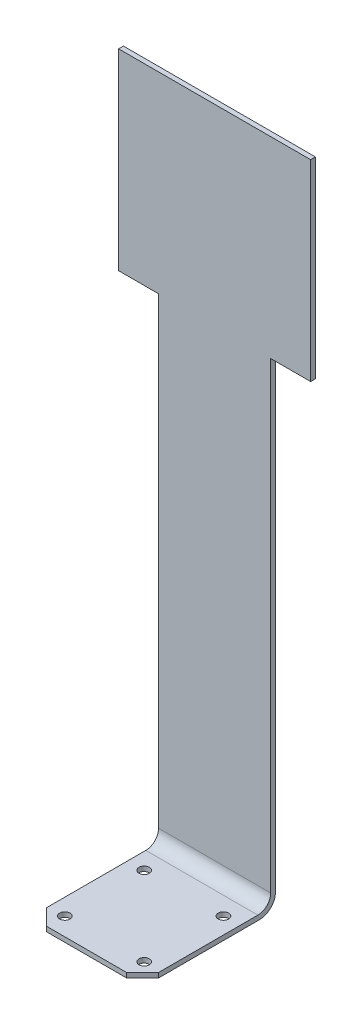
ISO-10303-21;
HEADER;
FILE_DESCRIPTION(('STEP AP214'),'2;1');
FILE_NAME('part.step','',(''),(''),'','','');
FILE_SCHEMA(('AUTOMOTIVE_DESIGN { 1 0 10303 214 1 1 1 1 }'));
ENDSEC;
DATA;
#1=APPLICATION_CONTEXT('core data for automotive mechanical design processes');
#2=APPLICATION_PROTOCOL_DEFINITION('international standard','automotive_design',2000,#1);
#3=PRODUCT_CONTEXT('',#1,'mechanical');
#4=PRODUCT('Part','Part','',(#3));
#5=PRODUCT_RELATED_PRODUCT_CATEGORY('part','',(#4));
#6=PRODUCT_DEFINITION_FORMATION('','',#4);
#7=PRODUCT_DEFINITION_CONTEXT('part definition',#1,'design');
#8=PRODUCT_DEFINITION('design','',#6,#7);
#9=PRODUCT_DEFINITION_SHAPE('','',#8);
#10=(LENGTH_UNIT() NAMED_UNIT(*) SI_UNIT(.MILLI.,.METRE.));
#11=(NAMED_UNIT(*) PLANE_ANGLE_UNIT() SI_UNIT($,.RADIAN.));
#12=(NAMED_UNIT(*) SI_UNIT($,.STERADIAN.) SOLID_ANGLE_UNIT());
#13=UNCERTAINTY_MEASURE_WITH_UNIT(LENGTH_MEASURE(1.E-05),#10,'distance_accuracy_value','');
#14=(GEOMETRIC_REPRESENTATION_CONTEXT(3) GLOBAL_UNCERTAINTY_ASSIGNED_CONTEXT((#13)) GLOBAL_UNIT_ASSIGNED_CONTEXT((#10,
#11,#12)) REPRESENTATION_CONTEXT('',''));
#15=CARTESIAN_POINT('',(0.,0.,0.));
#16=DIRECTION('',(0.,0.,1.));
#17=DIRECTION('',(1.,0.,0.));
#18=AXIS2_PLACEMENT_3D('',#15,#16,#17);
#19=CARTESIAN_POINT('',(0.,0.,1.5));
#20=DIRECTION('',(0.,0.,-1.));
#21=DIRECTION('',(-1.,0.,0.));
#22=AXIS2_PLACEMENT_3D('',#19,#20,#21);
#23=PLANE('',#22);
#24=DIRECTION('',(0.,-1.,0.));
#25=VECTOR('',#24,1.);
#26=CARTESIAN_POINT('',(-35.,-60.,1.5));
#27=LINE('',#26,#25);
#28=CARTESIAN_POINT('',(-35.,-60.,1.5));
#29=VERTEX_POINT('',#28);
#30=CARTESIAN_POINT('',(-35.,-349.,1.5));
#31=VERTEX_POINT('',#30);
#32=EDGE_CURVE('E187',#29,#31,#27,.T.);
#33=ORIENTED_EDGE('',*,*,#32,.T.);
#34=DIRECTION('',(-1.,0.,0.));
#35=VECTOR('',#34,1.);
#36=CARTESIAN_POINT('',(35.,-349.,1.5));
#37=LINE('',#36,#35);
#38=CARTESIAN_POINT('',(35.,-349.,1.5));
#39=VERTEX_POINT('',#38);
#40=EDGE_CURVE('E205',#31,#39,#37,.F.);
#41=ORIENTED_EDGE('',*,*,#40,.T.);
#42=DIRECTION('',(0.,1.,0.));
#43=VECTOR('',#42,1.);
#44=CARTESIAN_POINT('',(35.,-360.,1.5));
#45=LINE('',#44,#43);
#46=CARTESIAN_POINT('',(35.,-60.,1.5));
#47=VERTEX_POINT('',#46);
#48=EDGE_CURVE('E191',#39,#47,#45,.T.);
#49=ORIENTED_EDGE('',*,*,#48,.T.);
#50=DIRECTION('',(1.,0.,0.));
#51=VECTOR('',#50,1.);
#52=CARTESIAN_POINT('',(35.,-60.,1.5));
#53=LINE('',#52,#51);
#54=CARTESIAN_POINT('',(60.,-60.,1.5));
#55=VERTEX_POINT('',#54);
#56=EDGE_CURVE('E179',#47,#55,#53,.T.);
#57=ORIENTED_EDGE('',*,*,#56,.T.);
#58=DIRECTION('',(0.,1.,0.));
#59=VECTOR('',#58,1.);
#60=CARTESIAN_POINT('',(60.,-60.,1.5));
#61=LINE('',#60,#59);
#62=CARTESIAN_POINT('',(60.,60.,1.5));
#63=VERTEX_POINT('',#62);
#64=EDGE_CURVE('E174',#55,#63,#61,.T.);
#65=ORIENTED_EDGE('',*,*,#64,.T.);
#66=DIRECTION('',(-1.,0.,0.));
#67=VECTOR('',#66,1.);
#68=CARTESIAN_POINT('',(-59.9999999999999,60.,1.5));
#69=LINE('',#68,#67);
#70=CARTESIAN_POINT('',(-60.,60.,1.5));
#71=VERTEX_POINT('',#70);
#72=EDGE_CURVE('E153',#63,#71,#69,.T.);
#73=ORIENTED_EDGE('',*,*,#72,.T.);
#74=DIRECTION('',(0.,-1.,0.));
#75=VECTOR('',#74,1.);
#76=CARTESIAN_POINT('',(-59.9999999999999,-60.,1.5));
#77=LINE('',#76,#75);
#78=CARTESIAN_POINT('',(-59.9999999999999,-60.,1.49999999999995));
#79=VERTEX_POINT('',#78);
#80=EDGE_CURVE('E253',#71,#79,#77,.T.);
#81=ORIENTED_EDGE('',*,*,#80,.T.);
#82=DIRECTION('',(1.,0.,0.));
#83=VECTOR('',#82,1.);
#84=CARTESIAN_POINT('',(-59.9999999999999,-60.,1.5));
#85=LINE('',#84,#83);
#86=EDGE_CURVE('E192',#79,#29,#85,.T.);
#87=ORIENTED_EDGE('',*,*,#86,.T.);
#88=EDGE_LOOP('',(#33,#41,#49,#57,#65,#73,#81,#87));
#89=FACE_BOUND('',#88,.T.);
#90=ADVANCED_FACE('F33',(#89),#23,.F.);
#91=CARTESIAN_POINT('',(-59.9999999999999,60.,1.5));
#92=DIRECTION('',(0.,-1.,0.));
#93=DIRECTION('',(0.,0.,-1.));
#94=AXIS2_PLACEMENT_3D('',#91,#92,#93);
#95=PLANE('',#94);
#96=ORIENTED_EDGE('',*,*,#72,.F.);
#97=CARTESIAN_POINT('',(74.9248115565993,60.,0.));
#98=DIRECTION('',(0.,1.,0.));
#99=DIRECTION('',(0.,0.,1.));
#100=AXIS2_PLACEMENT_3D('',#97,#98,#99);
#101=CIRCLE('',#100,15.);
#102=CARTESIAN_POINT('',(60.,60.,-1.5));
#103=VERTEX_POINT('',#102);
#104=EDGE_CURVE('E136',#103,#63,#101,.T.);
#105=ORIENTED_EDGE('',*,*,#104,.F.);
#106=DIRECTION('',(-1.,0.,0.));
#107=VECTOR('',#106,1.);
#108=CARTESIAN_POINT('',(-59.9999999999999,60.,-1.5));
#109=LINE('',#108,#107);
#110=CARTESIAN_POINT('',(-59.9999999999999,60.,-1.5));
#111=VERTEX_POINT('',#110);
#112=EDGE_CURVE('E144',#103,#111,#109,.T.);
#113=ORIENTED_EDGE('',*,*,#112,.T.);
#114=CARTESIAN_POINT('',(-74.9248115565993,60.,0.));
#115=DIRECTION('',(0.,1.,0.));
#116=DIRECTION('',(0.,0.,1.));
#117=AXIS2_PLACEMENT_3D('',#114,#115,#116);
#118=CIRCLE('',#117,15.);
#119=EDGE_CURVE('E288',#71,#111,#118,.T.);
#120=ORIENTED_EDGE('',*,*,#119,.F.);
#121=EDGE_LOOP('',(#96,#105,#113,#120));
#122=FACE_BOUND('',#121,.T.);
#123=ADVANCED_FACE('F149',(#122),#95,.F.);
#124=CARTESIAN_POINT('',(-59.9999999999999,-60.,1.5));
#125=DIRECTION('',(0.,1.,0.));
#126=DIRECTION('',(0.,0.,1.));
#127=AXIS2_PLACEMENT_3D('',#124,#125,#126);
#128=PLANE('',#127);
#129=ORIENTED_EDGE('',*,*,#86,.F.);
#130=CARTESIAN_POINT('',(-74.9248115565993,-60.,0.));
#131=DIRECTION('',(0.,1.,0.));
#132=DIRECTION('',(0.,0.,1.));
#133=AXIS2_PLACEMENT_3D('',#130,#131,#132);
#134=CIRCLE('',#133,15.);
#135=CARTESIAN_POINT('',(-60.,-60.,-1.5));
#136=VERTEX_POINT('',#135);
#137=EDGE_CURVE('E145',#79,#136,#134,.T.);
#138=ORIENTED_EDGE('',*,*,#137,.T.);
#139=DIRECTION('',(1.,0.,0.));
#140=VECTOR('',#139,1.);
#141=CARTESIAN_POINT('',(-59.9999999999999,-60.,-1.5));
#142=LINE('',#141,#140);
#143=CARTESIAN_POINT('',(-35.,-60.,-1.5));
#144=VERTEX_POINT('',#143);
#145=EDGE_CURVE('E162',#136,#144,#142,.T.);
#146=ORIENTED_EDGE('',*,*,#145,.T.);
#147=DIRECTION('',(0.,0.,-1.));
#148=VECTOR('',#147,1.);
#149=CARTESIAN_POINT('',(-35.,-60.,1.5));
#150=LINE('',#149,#148);
#151=EDGE_CURVE('E183',#29,#144,#150,.T.);
#152=ORIENTED_EDGE('',*,*,#151,.F.);
#153=EDGE_LOOP('',(#129,#138,#146,#152));
#154=FACE_BOUND('',#153,.T.);
#155=ADVANCED_FACE('F256',(#154),#128,.F.);
#156=CARTESIAN_POINT('',(-35.,-60.,1.5));
#157=DIRECTION('',(1.,0.,0.));
#158=DIRECTION('',(0.,0.,-1.));
#159=AXIS2_PLACEMENT_3D('',#156,#157,#158);
#160=PLANE('',#159);
#161=DIRECTION('',(0.,0.,-1.));
#162=VECTOR('',#161,1.);
#163=CARTESIAN_POINT('',(-35.,-360.,1.5));
#164=LINE('',#163,#162);
#165=CARTESIAN_POINT('',(-35.,-360.,71.4999999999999));
#166=VERTEX_POINT('',#165);
#167=CARTESIAN_POINT('',(-35.,-360.,8.5));
#168=VERTEX_POINT('',#167);
#169=EDGE_CURVE('E181',#166,#168,#164,.T.);
#170=ORIENTED_EDGE('',*,*,#169,.F.);
#171=DIRECTION('',(0.,1.,0.));
#172=VECTOR('',#171,1.);
#173=CARTESIAN_POINT('',(-35.,-60.,71.4999999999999));
#174=LINE('',#173,#172);
#175=CARTESIAN_POINT('',(-35.,-357.,71.4999999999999));
#176=VERTEX_POINT('',#175);
#177=EDGE_CURVE('E11',#166,#176,#174,.T.);
#178=ORIENTED_EDGE('',*,*,#177,.T.);
#179=DIRECTION('',(0.,0.,-1.));
#180=VECTOR('',#179,1.);
#181=CARTESIAN_POINT('',(-35.,-357.,81.5));
#182=LINE('',#181,#180);
#183=CARTESIAN_POINT('',(-35.,-357.,9.49999999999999));
#184=VERTEX_POINT('',#183);
#185=EDGE_CURVE('E220',#176,#184,#182,.T.);
#186=ORIENTED_EDGE('',*,*,#185,.T.);
#187=CARTESIAN_POINT('',(-35.,-349.,9.49999999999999));
#188=DIRECTION('',(1.,0.,0.));
#189=DIRECTION('',(0.,0.,-1.));
#190=AXIS2_PLACEMENT_3D('',#187,#188,#189);
#191=CIRCLE('',#190,8.);
#192=EDGE_CURVE('E207',#184,#31,#191,.T.);
#193=ORIENTED_EDGE('',*,*,#192,.T.);
#194=ORIENTED_EDGE('',*,*,#32,.F.);
#195=ORIENTED_EDGE('',*,*,#151,.T.);
#196=DIRECTION('',(0.,-1.,0.));
#197=VECTOR('',#196,1.);
#198=CARTESIAN_POINT('',(-35.,-60.,-1.5));
#199=LINE('',#198,#197);
#200=CARTESIAN_POINT('',(-35.,-350.,-1.5));
#201=VERTEX_POINT('',#200);
#202=EDGE_CURVE('E167',#144,#201,#199,.T.);
#203=ORIENTED_EDGE('',*,*,#202,.T.);
#204=CARTESIAN_POINT('',(-35.,-350.,8.5));
#205=DIRECTION('',(1.,0.,0.));
#206=DIRECTION('',(0.,0.,-1.));
#207=AXIS2_PLACEMENT_3D('',#204,#205,#206);
#208=CIRCLE('',#207,10.);
#209=EDGE_CURVE('E229',#201,#168,#208,.F.);
#210=ORIENTED_EDGE('',*,*,#209,.T.);
#211=EDGE_LOOP('',(#170,#178,#186,#193,#194,#195,#203,#210));
#212=FACE_BOUND('',#211,.T.);
#213=ADVANCED_FACE('F247',(#212),#160,.F.);
#214=CARTESIAN_POINT('',(-35.,-360.,1.5));
#215=DIRECTION('',(0.,1.,0.));
#216=DIRECTION('',(0.,0.,1.));
#217=AXIS2_PLACEMENT_3D('',#214,#215,#216);
#218=PLANE('',#217);
#219=CARTESIAN_POINT('',(-24.7487373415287,-360.,70.248737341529));
#220=DIRECTION('',(0.,1.,0.));
#221=DIRECTION('',(0.,0.,1.));
#222=AXIS2_PLACEMENT_3D('',#219,#220,#221);
#223=CIRCLE('',#222,3.25);
#224=CARTESIAN_POINT('',(-24.7487373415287,-360.,73.498737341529));
#225=VERTEX_POINT('',#224);
#226=EDGE_CURVE('E383',#225,#225,#223,.T.);
#227=ORIENTED_EDGE('',*,*,#226,.T.);
#228=EDGE_LOOP('',(#227));
#229=FACE_BOUND('',#228,.T.);
#230=CARTESIAN_POINT('',(24.7487373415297,-360.,70.2487373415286));
#231=DIRECTION('',(0.,1.,0.));
#232=DIRECTION('',(0.,0.,1.));
#233=AXIS2_PLACEMENT_3D('',#230,#231,#232);
#234=CIRCLE('',#233,3.25);
#235=CARTESIAN_POINT('',(24.7487373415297,-360.,73.4987373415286));
#236=VERTEX_POINT('',#235);
#237=EDGE_CURVE('E380',#236,#236,#234,.T.);
#238=ORIENTED_EDGE('',*,*,#237,.T.);
#239=EDGE_LOOP('',(#238));
#240=FACE_BOUND('',#239,.T.);
#241=CARTESIAN_POINT('',(24.7487373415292,-360.,20.7512626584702));
#242=DIRECTION('',(0.,1.,0.));
#243=DIRECTION('',(0.,0.,1.));
#244=AXIS2_PLACEMENT_3D('',#241,#242,#243);
#245=CIRCLE('',#244,3.25);
#246=CARTESIAN_POINT('',(24.7487373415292,-360.,24.0012626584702));
#247=VERTEX_POINT('',#246);
#248=EDGE_CURVE('E373',#247,#247,#245,.T.);
#249=ORIENTED_EDGE('',*,*,#248,.T.);
#250=EDGE_LOOP('',(#249));
#251=FACE_BOUND('',#250,.T.);
#252=CARTESIAN_POINT('',(-24.7487373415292,-360.,20.7512626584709));
#253=DIRECTION('',(0.,1.,0.));
#254=DIRECTION('',(0.,0.,1.));
#255=AXIS2_PLACEMENT_3D('',#252,#253,#254);
#256=CIRCLE('',#255,3.25);
#257=CARTESIAN_POINT('',(-24.7487373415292,-360.,24.0012626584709));
#258=VERTEX_POINT('',#257);
#259=EDGE_CURVE('E279',#258,#258,#256,.T.);
#260=ORIENTED_EDGE('',*,*,#259,.T.);
#261=EDGE_LOOP('',(#260));
#262=FACE_BOUND('',#261,.T.);
#263=DIRECTION('',(0.,0.,-1.));
#264=VECTOR('',#263,1.);
#265=CARTESIAN_POINT('',(35.,-360.,1.5));
#266=LINE('',#265,#264);
#267=CARTESIAN_POINT('',(35.,-360.,71.4999999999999));
#268=VERTEX_POINT('',#267);
#269=CARTESIAN_POINT('',(35.,-360.,8.5));
#270=VERTEX_POINT('',#269);
#271=EDGE_CURVE('E178',#268,#270,#266,.T.);
#272=ORIENTED_EDGE('',*,*,#271,.F.);
#273=DIRECTION('',(0.707106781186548,0.,-0.707106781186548));
#274=VECTOR('',#273,1.);
#275=CARTESIAN_POINT('',(25.,-360.,81.5));
#276=LINE('',#275,#274);
#277=CARTESIAN_POINT('',(25.,-360.,81.5));
#278=VERTEX_POINT('',#277);
#279=EDGE_CURVE('E41',#268,#278,#276,.F.);
#280=ORIENTED_EDGE('',*,*,#279,.T.);
#281=DIRECTION('',(1.,0.,0.));
#282=VECTOR('',#281,1.);
#283=CARTESIAN_POINT('',(-35.,-360.,81.5));
#284=LINE('',#283,#282);
#285=CARTESIAN_POINT('',(-24.9999999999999,-360.,81.5));
#286=VERTEX_POINT('',#285);
#287=EDGE_CURVE('E273',#286,#278,#284,.T.);
#288=ORIENTED_EDGE('',*,*,#287,.F.);
#289=DIRECTION('',(0.707106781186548,0.,0.707106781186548));
#290=VECTOR('',#289,1.);
#291=CARTESIAN_POINT('',(-24.9999999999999,-360.,81.5));
#292=LINE('',#291,#290);
#293=EDGE_CURVE('E48',#286,#166,#292,.F.);
#294=ORIENTED_EDGE('',*,*,#293,.T.);
#295=ORIENTED_EDGE('',*,*,#169,.T.);
#296=DIRECTION('',(1.,0.,0.));
#297=VECTOR('',#296,1.);
#298=CARTESIAN_POINT('',(35.,-360.,8.5));
#299=LINE('',#298,#297);
#300=EDGE_CURVE('E186',#168,#270,#299,.T.);
#301=ORIENTED_EDGE('',*,*,#300,.T.);
#302=EDGE_LOOP('',(#272,#280,#288,#294,#295,#301));
#303=FACE_BOUND('',#302,.T.);
#304=ADVANCED_FACE('F262',(#229,#240,#251,#262,#303),#218,.F.);
#305=CARTESIAN_POINT('',(35.,-360.,1.5));
#306=DIRECTION('',(-1.,0.,0.));
#307=DIRECTION('',(0.,0.,1.));
#308=AXIS2_PLACEMENT_3D('',#305,#306,#307);
#309=PLANE('',#308);
#310=DIRECTION('',(0.,0.,-1.));
#311=VECTOR('',#310,1.);
#312=CARTESIAN_POINT('',(35.,-357.,81.5));
#313=LINE('',#312,#311);
#314=CARTESIAN_POINT('',(35.,-357.,71.4999999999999));
#315=VERTEX_POINT('',#314);
#316=CARTESIAN_POINT('',(35.,-357.,9.49999999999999));
#317=VERTEX_POINT('',#316);
#318=EDGE_CURVE('E155',#315,#317,#313,.T.);
#319=ORIENTED_EDGE('',*,*,#318,.F.);
#320=DIRECTION('',(0.,-1.,0.));
#321=VECTOR('',#320,1.);
#322=CARTESIAN_POINT('',(35.,-360.,71.4999999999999));
#323=LINE('',#322,#321);
#324=EDGE_CURVE('E56',#315,#268,#323,.T.);
#325=ORIENTED_EDGE('',*,*,#324,.T.);
#326=ORIENTED_EDGE('',*,*,#271,.T.);
#327=CARTESIAN_POINT('',(35.,-350.,8.5));
#328=DIRECTION('',(-1.,0.,0.));
#329=DIRECTION('',(0.,0.,1.));
#330=AXIS2_PLACEMENT_3D('',#327,#328,#329);
#331=CIRCLE('',#330,10.);
#332=CARTESIAN_POINT('',(35.,-350.,-1.5));
#333=VERTEX_POINT('',#332);
#334=EDGE_CURVE('E226',#270,#333,#331,.F.);
#335=ORIENTED_EDGE('',*,*,#334,.T.);
#336=DIRECTION('',(0.,1.,0.));
#337=VECTOR('',#336,1.);
#338=CARTESIAN_POINT('',(35.,-360.,-1.5));
#339=LINE('',#338,#337);
#340=CARTESIAN_POINT('',(35.,-60.,-1.5));
#341=VERTEX_POINT('',#340);
#342=EDGE_CURVE('E170',#333,#341,#339,.T.);
#343=ORIENTED_EDGE('',*,*,#342,.T.);
#344=DIRECTION('',(0.,0.,-1.));
#345=VECTOR('',#344,1.);
#346=CARTESIAN_POINT('',(35.,-60.,1.5));
#347=LINE('',#346,#345);
#348=EDGE_CURVE('E175',#47,#341,#347,.T.);
#349=ORIENTED_EDGE('',*,*,#348,.F.);
#350=ORIENTED_EDGE('',*,*,#48,.F.);
#351=CARTESIAN_POINT('',(35.,-349.,9.49999999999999));
#352=DIRECTION('',(-1.,0.,0.));
#353=DIRECTION('',(0.,0.,1.));
#354=AXIS2_PLACEMENT_3D('',#351,#352,#353);
#355=CIRCLE('',#354,8.);
#356=EDGE_CURVE('E209',#39,#317,#355,.T.);
#357=ORIENTED_EDGE('',*,*,#356,.T.);
#358=EDGE_LOOP('',(#319,#325,#326,#335,#343,#349,#350,#357));
#359=FACE_BOUND('',#358,.T.);
#360=ADVANCED_FACE('F282',(#359),#309,.F.);
#361=CARTESIAN_POINT('',(35.,-60.,1.5));
#362=DIRECTION('',(0.,1.,0.));
#363=DIRECTION('',(0.,0.,1.));
#364=AXIS2_PLACEMENT_3D('',#361,#362,#363);
#365=PLANE('',#364);
#366=DIRECTION('',(1.,0.,0.));
#367=VECTOR('',#366,1.);
#368=CARTESIAN_POINT('',(35.,-60.,-1.5));
#369=LINE('',#368,#367);
#370=CARTESIAN_POINT('',(60.,-60.,-1.5));
#371=VERTEX_POINT('',#370);
#372=EDGE_CURVE('E172',#341,#371,#369,.T.);
#373=ORIENTED_EDGE('',*,*,#372,.T.);
#374=CARTESIAN_POINT('',(74.9248115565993,-60.,0.));
#375=DIRECTION('',(0.,1.,0.));
#376=DIRECTION('',(0.,0.,1.));
#377=AXIS2_PLACEMENT_3D('',#374,#375,#376);
#378=CIRCLE('',#377,15.);
#379=EDGE_CURVE('E139',#371,#55,#378,.T.);
#380=ORIENTED_EDGE('',*,*,#379,.T.);
#381=ORIENTED_EDGE('',*,*,#56,.F.);
#382=ORIENTED_EDGE('',*,*,#348,.T.);
#383=EDGE_LOOP('',(#373,#380,#381,#382));
#384=FACE_BOUND('',#383,.T.);
#385=ADVANCED_FACE('F287',(#384),#365,.F.);
#386=CARTESIAN_POINT('',(0.,0.,-1.5));
#387=DIRECTION('',(0.,0.,-1.));
#388=DIRECTION('',(-1.,0.,0.));
#389=AXIS2_PLACEMENT_3D('',#386,#387,#388);
#390=PLANE('',#389);
#391=ORIENTED_EDGE('',*,*,#342,.F.);
#392=DIRECTION('',(1.,0.,0.));
#393=VECTOR('',#392,1.);
#394=CARTESIAN_POINT('',(-35.,-350.,-1.5));
#395=LINE('',#394,#393);
#396=EDGE_CURVE('E228',#333,#201,#395,.F.);
#397=ORIENTED_EDGE('',*,*,#396,.T.);
#398=ORIENTED_EDGE('',*,*,#202,.F.);
#399=ORIENTED_EDGE('',*,*,#145,.F.);
#400=DIRECTION('',(0.,-1.,0.));
#401=VECTOR('',#400,1.);
#402=CARTESIAN_POINT('',(-59.9999999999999,-60.,-1.5));
#403=LINE('',#402,#401);
#404=EDGE_CURVE('E160',#111,#136,#403,.T.);
#405=ORIENTED_EDGE('',*,*,#404,.F.);
#406=ORIENTED_EDGE('',*,*,#112,.F.);
#407=DIRECTION('',(0.,1.,0.));
#408=VECTOR('',#407,1.);
#409=CARTESIAN_POINT('',(60.,-60.,-1.5));
#410=LINE('',#409,#408);
#411=EDGE_CURVE('E133',#371,#103,#410,.T.);
#412=ORIENTED_EDGE('',*,*,#411,.F.);
#413=ORIENTED_EDGE('',*,*,#372,.F.);
#414=EDGE_LOOP('',(#391,#397,#398,#399,#405,#406,#412,#413));
#415=FACE_BOUND('',#414,.T.);
#416=ADVANCED_FACE('F158',(#415),#390,.T.);
#417=CARTESIAN_POINT('',(-74.9248115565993,-360.,0.));
#418=DIRECTION('',(0.,1.,0.));
#419=DIRECTION('',(0.,0.,1.));
#420=AXIS2_PLACEMENT_3D('',#417,#418,#419);
#421=CYLINDRICAL_SURFACE('',#420,15.);
#422=ORIENTED_EDGE('',*,*,#119,.T.);
#423=ORIENTED_EDGE('',*,*,#404,.T.);
#424=ORIENTED_EDGE('',*,*,#137,.F.);
#425=ORIENTED_EDGE('',*,*,#80,.F.);
#426=EDGE_LOOP('',(#422,#423,#424,#425));
#427=FACE_BOUND('',#426,.T.);
#428=ADVANCED_FACE('F296',(#427),#421,.F.);
#429=CARTESIAN_POINT('',(74.9248115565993,-360.,0.));
#430=DIRECTION('',(0.,1.,0.));
#431=DIRECTION('',(0.,0.,1.));
#432=AXIS2_PLACEMENT_3D('',#429,#430,#431);
#433=CYLINDRICAL_SURFACE('',#432,15.);
#434=ORIENTED_EDGE('',*,*,#379,.F.);
#435=ORIENTED_EDGE('',*,*,#411,.T.);
#436=ORIENTED_EDGE('',*,*,#104,.T.);
#437=ORIENTED_EDGE('',*,*,#64,.F.);
#438=EDGE_LOOP('',(#434,#435,#436,#437));
#439=FACE_BOUND('',#438,.T.);
#440=ADVANCED_FACE('F135',(#439),#433,.F.);
#441=CARTESIAN_POINT('',(-35.,-357.,81.5));
#442=DIRECTION('',(0.,-1.,0.));
#443=DIRECTION('',(0.,0.,-1.));
#444=AXIS2_PLACEMENT_3D('',#441,#442,#443);
#445=PLANE('',#444);
#446=CARTESIAN_POINT('',(-24.7487373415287,-357.,70.248737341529));
#447=DIRECTION('',(0.,1.,0.));
#448=DIRECTION('',(0.,0.,1.));
#449=AXIS2_PLACEMENT_3D('',#446,#447,#448);
#450=CIRCLE('',#449,3.25);
#451=CARTESIAN_POINT('',(-24.7487373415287,-357.,73.498737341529));
#452=VERTEX_POINT('',#451);
#453=EDGE_CURVE('E360',#452,#452,#450,.T.);
#454=ORIENTED_EDGE('',*,*,#453,.F.);
#455=EDGE_LOOP('',(#454));
#456=FACE_BOUND('',#455,.T.);
#457=CARTESIAN_POINT('',(24.7487373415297,-357.,70.2487373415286));
#458=DIRECTION('',(0.,1.,0.));
#459=DIRECTION('',(0.,0.,1.));
#460=AXIS2_PLACEMENT_3D('',#457,#458,#459);
#461=CIRCLE('',#460,3.25);
#462=CARTESIAN_POINT('',(24.7487373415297,-357.,73.4987373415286));
#463=VERTEX_POINT('',#462);
#464=EDGE_CURVE('E364',#463,#463,#461,.T.);
#465=ORIENTED_EDGE('',*,*,#464,.F.);
#466=EDGE_LOOP('',(#465));
#467=FACE_BOUND('',#466,.T.);
#468=CARTESIAN_POINT('',(24.7487373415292,-357.,20.7512626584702));
#469=DIRECTION('',(0.,1.,0.));
#470=DIRECTION('',(0.,0.,1.));
#471=AXIS2_PLACEMENT_3D('',#468,#469,#470);
#472=CIRCLE('',#471,3.25);
#473=CARTESIAN_POINT('',(24.7487373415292,-357.,24.0012626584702));
#474=VERTEX_POINT('',#473);
#475=EDGE_CURVE('E368',#474,#474,#472,.T.);
#476=ORIENTED_EDGE('',*,*,#475,.F.);
#477=EDGE_LOOP('',(#476));
#478=FACE_BOUND('',#477,.T.);
#479=CARTESIAN_POINT('',(-24.7487373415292,-357.,20.7512626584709));
#480=DIRECTION('',(0.,1.,0.));
#481=DIRECTION('',(0.,0.,1.));
#482=AXIS2_PLACEMENT_3D('',#479,#480,#481);
#483=CIRCLE('',#482,3.25);
#484=CARTESIAN_POINT('',(-24.7487373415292,-357.,24.0012626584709));
#485=VERTEX_POINT('',#484);
#486=EDGE_CURVE('E371',#485,#485,#483,.T.);
#487=ORIENTED_EDGE('',*,*,#486,.F.);
#488=EDGE_LOOP('',(#487));
#489=FACE_BOUND('',#488,.T.);
#490=DIRECTION('',(-1.,0.,0.));
#491=VECTOR('',#490,1.);
#492=CARTESIAN_POINT('',(-35.,-357.,81.5));
#493=LINE('',#492,#491);
#494=CARTESIAN_POINT('',(25.,-357.,81.5));
#495=VERTEX_POINT('',#494);
#496=CARTESIAN_POINT('',(-24.9999999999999,-357.,81.5));
#497=VERTEX_POINT('',#496);
#498=EDGE_CURVE('E278',#495,#497,#493,.T.);
#499=ORIENTED_EDGE('',*,*,#498,.F.);
#500=DIRECTION('',(-0.707106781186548,0.,0.707106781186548));
#501=VECTOR('',#500,1.);
#502=CARTESIAN_POINT('',(25.,-357.,81.5));
#503=LINE('',#502,#501);
#504=EDGE_CURVE('E268',#495,#315,#503,.F.);
#505=ORIENTED_EDGE('',*,*,#504,.T.);
#506=ORIENTED_EDGE('',*,*,#318,.T.);
#507=DIRECTION('',(-1.,0.,0.));
#508=VECTOR('',#507,1.);
#509=CARTESIAN_POINT('',(-35.,-357.,9.49999999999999));
#510=LINE('',#509,#508);
#511=EDGE_CURVE('E203',#317,#184,#510,.T.);
#512=ORIENTED_EDGE('',*,*,#511,.T.);
#513=ORIENTED_EDGE('',*,*,#185,.F.);
#514=DIRECTION('',(-0.707106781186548,0.,-0.707106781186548));
#515=VECTOR('',#514,1.);
#516=CARTESIAN_POINT('',(-24.9999999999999,-357.,81.5));
#517=LINE('',#516,#515);
#518=EDGE_CURVE('E218',#176,#497,#517,.F.);
#519=ORIENTED_EDGE('',*,*,#518,.T.);
#520=EDGE_LOOP('',(#499,#505,#506,#512,#513,#519));
#521=FACE_BOUND('',#520,.T.);
#522=ADVANCED_FACE('F239',(#456,#467,#478,#489,#521),#445,.F.);
#523=CARTESIAN_POINT('',(0.,0.,81.5));
#524=DIRECTION('',(0.,0.,-1.));
#525=DIRECTION('',(-1.,0.,0.));
#526=AXIS2_PLACEMENT_3D('',#523,#524,#525);
#527=PLANE('',#526);
#528=ORIENTED_EDGE('',*,*,#287,.T.);
#529=DIRECTION('',(0.,1.,0.));
#530=VECTOR('',#529,1.);
#531=CARTESIAN_POINT('',(25.,0.,81.5));
#532=LINE('',#531,#530);
#533=EDGE_CURVE('E215',#278,#495,#532,.T.);
#534=ORIENTED_EDGE('',*,*,#533,.T.);
#535=ORIENTED_EDGE('',*,*,#498,.T.);
#536=DIRECTION('',(0.,-1.,0.));
#537=VECTOR('',#536,1.);
#538=CARTESIAN_POINT('',(-24.9999999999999,0.,81.5));
#539=LINE('',#538,#537);
#540=EDGE_CURVE('E212',#497,#286,#539,.T.);
#541=ORIENTED_EDGE('',*,*,#540,.T.);
#542=EDGE_LOOP('',(#528,#534,#535,#541));
#543=FACE_BOUND('',#542,.T.);
#544=ADVANCED_FACE('F277',(#543),#527,.F.);
#545=CARTESIAN_POINT('',(-35.,-350.,8.5));
#546=DIRECTION('',(-1.,0.,0.));
#547=DIRECTION('',(0.,0.,1.));
#548=AXIS2_PLACEMENT_3D('',#545,#546,#547);
#549=CYLINDRICAL_SURFACE('',#548,10.);
#550=ORIENTED_EDGE('',*,*,#209,.F.);
#551=ORIENTED_EDGE('',*,*,#396,.F.);
#552=ORIENTED_EDGE('',*,*,#334,.F.);
#553=ORIENTED_EDGE('',*,*,#300,.F.);
#554=EDGE_LOOP('',(#550,#551,#552,#553));
#555=FACE_BOUND('',#554,.T.);
#556=ADVANCED_FACE('F261',(#555),#549,.T.);
#557=CARTESIAN_POINT('',(-35.,-349.,9.49999999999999));
#558=DIRECTION('',(1.,0.,0.));
#559=DIRECTION('',(0.,0.,-1.));
#560=AXIS2_PLACEMENT_3D('',#557,#558,#559);
#561=CYLINDRICAL_SURFACE('',#560,8.);
#562=ORIENTED_EDGE('',*,*,#356,.F.);
#563=ORIENTED_EDGE('',*,*,#40,.F.);
#564=ORIENTED_EDGE('',*,*,#192,.F.);
#565=ORIENTED_EDGE('',*,*,#511,.F.);
#566=EDGE_LOOP('',(#562,#563,#564,#565));
#567=FACE_BOUND('',#566,.T.);
#568=ADVANCED_FACE('F244',(#567),#561,.F.);
#569=CARTESIAN_POINT('',(-24.7487373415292,-360.,20.7512626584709));
#570=DIRECTION('',(0.,1.,0.));
#571=DIRECTION('',(0.,0.,1.));
#572=AXIS2_PLACEMENT_3D('',#569,#570,#571);
#573=CYLINDRICAL_SURFACE('',#572,3.25);
#574=ORIENTED_EDGE('',*,*,#259,.F.);
#575=EDGE_LOOP('',(#574));
#576=FACE_BOUND('',#575,.T.);
#577=ORIENTED_EDGE('',*,*,#486,.T.);
#578=EDGE_LOOP('',(#577));
#579=FACE_BOUND('',#578,.T.);
#580=ADVANCED_FACE('F326',(#576,#579),#573,.F.);
#581=CARTESIAN_POINT('',(24.7487373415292,-360.,20.7512626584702));
#582=DIRECTION('',(0.,1.,0.));
#583=DIRECTION('',(0.,0.,1.));
#584=AXIS2_PLACEMENT_3D('',#581,#582,#583);
#585=CYLINDRICAL_SURFACE('',#584,3.25);
#586=ORIENTED_EDGE('',*,*,#248,.F.);
#587=EDGE_LOOP('',(#586));
#588=FACE_BOUND('',#587,.T.);
#589=ORIENTED_EDGE('',*,*,#475,.T.);
#590=EDGE_LOOP('',(#589));
#591=FACE_BOUND('',#590,.T.);
#592=ADVANCED_FACE('F339',(#588,#591),#585,.F.);
#593=CARTESIAN_POINT('',(24.7487373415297,-360.,70.2487373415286));
#594=DIRECTION('',(0.,1.,0.));
#595=DIRECTION('',(0.,0.,1.));
#596=AXIS2_PLACEMENT_3D('',#593,#594,#595);
#597=CYLINDRICAL_SURFACE('',#596,3.25);
#598=ORIENTED_EDGE('',*,*,#237,.F.);
#599=EDGE_LOOP('',(#598));
#600=FACE_BOUND('',#599,.T.);
#601=ORIENTED_EDGE('',*,*,#464,.T.);
#602=EDGE_LOOP('',(#601));
#603=FACE_BOUND('',#602,.T.);
#604=ADVANCED_FACE('F333',(#600,#603),#597,.F.);
#605=CARTESIAN_POINT('',(-24.7487373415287,-360.,70.248737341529));
#606=DIRECTION('',(0.,1.,0.));
#607=DIRECTION('',(0.,0.,1.));
#608=AXIS2_PLACEMENT_3D('',#605,#606,#607);
#609=CYLINDRICAL_SURFACE('',#608,3.25);
#610=ORIENTED_EDGE('',*,*,#226,.F.);
#611=EDGE_LOOP('',(#610));
#612=FACE_BOUND('',#611,.T.);
#613=ORIENTED_EDGE('',*,*,#453,.T.);
#614=EDGE_LOOP('',(#613));
#615=FACE_BOUND('',#614,.T.);
#616=ADVANCED_FACE('F328',(#612,#615),#609,.F.);
#617=CARTESIAN_POINT('',(25.,0.,81.5));
#618=DIRECTION('',(-0.707106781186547,0.,-0.707106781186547));
#619=DIRECTION('',(0.,1.,0.));
#620=AXIS2_PLACEMENT_3D('',#617,#618,#619);
#621=PLANE('',#620);
#622=ORIENTED_EDGE('',*,*,#279,.F.);
#623=ORIENTED_EDGE('',*,*,#324,.F.);
#624=ORIENTED_EDGE('',*,*,#504,.F.);
#625=ORIENTED_EDGE('',*,*,#533,.F.);
#626=EDGE_LOOP('',(#622,#623,#624,#625));
#627=FACE_BOUND('',#626,.T.);
#628=ADVANCED_FACE('F281',(#627),#621,.F.);
#629=CARTESIAN_POINT('',(-24.9999999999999,0.,81.5));
#630=DIRECTION('',(0.707106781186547,0.,-0.707106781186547));
#631=DIRECTION('',(0.,-1.,0.));
#632=AXIS2_PLACEMENT_3D('',#629,#630,#631);
#633=PLANE('',#632);
#634=ORIENTED_EDGE('',*,*,#518,.F.);
#635=ORIENTED_EDGE('',*,*,#177,.F.);
#636=ORIENTED_EDGE('',*,*,#293,.F.);
#637=ORIENTED_EDGE('',*,*,#540,.F.);
#638=EDGE_LOOP('',(#634,#635,#636,#637));
#639=FACE_BOUND('',#638,.T.);
#640=ADVANCED_FACE('F35',(#639),#633,.F.);
#641=CLOSED_SHELL('',(#90,#123,#155,#213,#304,#360,#385,#416,#428,#440,#522,#544,#556,#568,#580,
#592,#604,#616,#628,#640));
#642=MANIFOLD_SOLID_BREP('B2',#641);
#643=ADVANCED_BREP_SHAPE_REPRESENTATION('',(#18,#642),#14);
#644=SHAPE_DEFINITION_REPRESENTATION(#9,#643);
ENDSEC;
END-ISO-10303-21;
